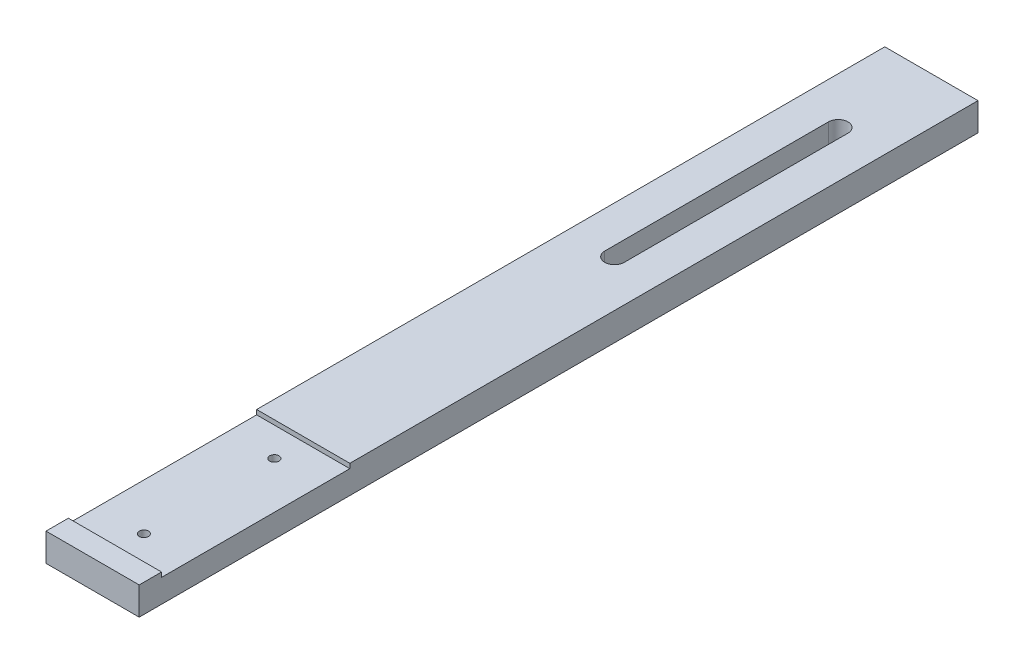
ISO-10303-21;
HEADER;
FILE_DESCRIPTION(('STEP AP214'),'2;1');
FILE_NAME('part.step','',(''),(''),'','','');
FILE_SCHEMA(('AUTOMOTIVE_DESIGN { 1 0 10303 214 1 1 1 1 }'));
ENDSEC;
DATA;
#1=APPLICATION_CONTEXT('core data for automotive mechanical design processes');
#2=APPLICATION_PROTOCOL_DEFINITION('international standard','automotive_design',2000,#1);
#3=PRODUCT_CONTEXT('',#1,'mechanical');
#4=PRODUCT('Part','Part','',(#3));
#5=PRODUCT_RELATED_PRODUCT_CATEGORY('part','',(#4));
#6=PRODUCT_DEFINITION_FORMATION('','',#4);
#7=PRODUCT_DEFINITION_CONTEXT('part definition',#1,'design');
#8=PRODUCT_DEFINITION('design','',#6,#7);
#9=PRODUCT_DEFINITION_SHAPE('','',#8);
#10=(LENGTH_UNIT() NAMED_UNIT(*) SI_UNIT(.MILLI.,.METRE.));
#11=(NAMED_UNIT(*) PLANE_ANGLE_UNIT() SI_UNIT($,.RADIAN.));
#12=(NAMED_UNIT(*) SI_UNIT($,.STERADIAN.) SOLID_ANGLE_UNIT());
#13=UNCERTAINTY_MEASURE_WITH_UNIT(LENGTH_MEASURE(1.E-05),#10,'distance_accuracy_value','');
#14=(GEOMETRIC_REPRESENTATION_CONTEXT(3) GLOBAL_UNCERTAINTY_ASSIGNED_CONTEXT((#13)) GLOBAL_UNIT_ASSIGNED_CONTEXT((#10,
#11,#12)) REPRESENTATION_CONTEXT('',''));
#15=CARTESIAN_POINT('',(0.,0.,0.));
#16=DIRECTION('',(0.,0.,1.));
#17=DIRECTION('',(1.,0.,0.));
#18=AXIS2_PLACEMENT_3D('',#15,#16,#17);
#19=CARTESIAN_POINT('',(8.32667268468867E-13,15.,450.));
#20=DIRECTION('',(0.,-1.,0.));
#21=DIRECTION('',(0.,0.,-1.));
#22=AXIS2_PLACEMENT_3D('',#19,#20,#21);
#23=PLANE('',#22);
#24=DIRECTION('',(0.,0.,-1.));
#25=VECTOR('',#24,1.);
#26=CARTESIAN_POINT('',(50.0000000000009,15.,450.));
#27=LINE('',#26,#25);
#28=CARTESIAN_POINT('',(50.0000000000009,15.,450.));
#29=VERTEX_POINT('',#28);
#30=CARTESIAN_POINT('',(50.0000000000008,15.,438.));
#31=VERTEX_POINT('',#30);
#32=EDGE_CURVE('E266',#29,#31,#27,.T.);
#33=ORIENTED_EDGE('',*,*,#32,.T.);
#34=DIRECTION('',(0.999999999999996,0.,0.));
#35=VECTOR('',#34,1.);
#36=CARTESIAN_POINT('',(-0.000999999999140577,15.,438.));
#37=LINE('',#36,#35);
#38=CARTESIAN_POINT('',(8.32667268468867E-13,15.,438.));
#39=VERTEX_POINT('',#38);
#40=EDGE_CURVE('E170',#39,#31,#37,.T.);
#41=ORIENTED_EDGE('',*,*,#40,.F.);
#42=DIRECTION('',(0.,0.,-1.));
#43=VECTOR('',#42,1.);
#44=CARTESIAN_POINT('',(8.32667268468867E-13,15.,450.));
#45=LINE('',#44,#43);
#46=CARTESIAN_POINT('',(8.32667268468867E-13,15.,450.));
#47=VERTEX_POINT('',#46);
#48=EDGE_CURVE('E156',#47,#39,#45,.T.);
#49=ORIENTED_EDGE('',*,*,#48,.F.);
#50=DIRECTION('',(-0.999999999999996,0.,0.));
#51=VECTOR('',#50,1.);
#52=CARTESIAN_POINT('',(8.32667268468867E-13,15.,450.));
#53=LINE('',#52,#51);
#54=EDGE_CURVE('E246',#29,#47,#53,.T.);
#55=ORIENTED_EDGE('',*,*,#54,.F.);
#56=EDGE_LOOP('',(#33,#41,#49,#55));
#57=FACE_BOUND('',#56,.T.);
#58=ADVANCED_FACE('F40',(#57),#23,.F.);
#59=CARTESIAN_POINT('',(8.88178419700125E-13,0.,450.));
#60=DIRECTION('',(0.999999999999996,0.,0.));
#61=DIRECTION('',(0.,0.,-1.));
#62=AXIS2_PLACEMENT_3D('',#59,#60,#61);
#63=PLANE('',#62);
#64=ORIENTED_EDGE('',*,*,#48,.T.);
#65=DIRECTION('',(0.,1.,0.));
#66=VECTOR('',#65,1.);
#67=CARTESIAN_POINT('',(8.32667268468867E-13,15.,438.));
#68=LINE('',#67,#66);
#69=CARTESIAN_POINT('',(8.32667268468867E-13,12.5000000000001,438.));
#70=VERTEX_POINT('',#69);
#71=EDGE_CURVE('E133',#70,#39,#68,.T.);
#72=ORIENTED_EDGE('',*,*,#71,.F.);
#73=DIRECTION('',(0.,0.,1.));
#74=VECTOR('',#73,1.);
#75=CARTESIAN_POINT('',(8.32667268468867E-13,12.5000000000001,438.));
#76=LINE('',#75,#74);
#77=CARTESIAN_POINT('',(8.32667268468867E-13,12.5000000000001,337.));
#78=VERTEX_POINT('',#77);
#79=EDGE_CURVE('E144',#78,#70,#76,.T.);
#80=ORIENTED_EDGE('',*,*,#79,.F.);
#81=DIRECTION('',(0.,-1.,0.));
#82=VECTOR('',#81,1.);
#83=CARTESIAN_POINT('',(8.32667268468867E-13,15.,337.));
#84=LINE('',#83,#82);
#85=CARTESIAN_POINT('',(8.32667268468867E-13,15.,337.));
#86=VERTEX_POINT('',#85);
#87=EDGE_CURVE('E158',#86,#78,#84,.T.);
#88=ORIENTED_EDGE('',*,*,#87,.F.);
#89=CARTESIAN_POINT('',(8.88178419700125E-13,15.,0.));
#90=VERTEX_POINT('',#89);
#91=EDGE_CURVE('E249',#86,#90,#45,.T.);
#92=ORIENTED_EDGE('',*,*,#91,.T.);
#93=DIRECTION('',(0.,-1.,0.));
#94=VECTOR('',#93,1.);
#95=CARTESIAN_POINT('',(8.88178419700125E-13,0.,0.));
#96=LINE('',#95,#94);
#97=CARTESIAN_POINT('',(8.88178419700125E-13,0.,0.));
#98=VERTEX_POINT('',#97);
#99=EDGE_CURVE('E234',#90,#98,#96,.T.);
#100=ORIENTED_EDGE('',*,*,#99,.T.);
#101=DIRECTION('',(0.,0.,-1.));
#102=VECTOR('',#101,1.);
#103=CARTESIAN_POINT('',(8.88178419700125E-13,0.,450.));
#104=LINE('',#103,#102);
#105=CARTESIAN_POINT('',(8.88178419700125E-13,0.,450.));
#106=VERTEX_POINT('',#105);
#107=EDGE_CURVE('E11',#106,#98,#104,.T.);
#108=ORIENTED_EDGE('',*,*,#107,.F.);
#109=DIRECTION('',(0.,-1.,0.));
#110=VECTOR('',#109,1.);
#111=CARTESIAN_POINT('',(8.88178419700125E-13,0.,450.));
#112=LINE('',#111,#110);
#113=EDGE_CURVE('E235',#47,#106,#112,.T.);
#114=ORIENTED_EDGE('',*,*,#113,.F.);
#115=EDGE_LOOP('',(#64,#72,#80,#88,#92,#100,#108,#114));
#116=FACE_BOUND('',#115,.T.);
#117=ADVANCED_FACE('F42',(#116),#63,.F.);
#118=CARTESIAN_POINT('',(8.88178419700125E-13,0.,450.));
#119=DIRECTION('',(0.,1.,0.));
#120=DIRECTION('',(0.,0.,1.));
#121=AXIS2_PLACEMENT_3D('',#118,#119,#120);
#122=PLANE('',#121);
#123=DIRECTION('',(0.,0.,1.));
#124=VECTOR('',#123,1.);
#125=CARTESIAN_POINT('',(19.7500000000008,0.,170.));
#126=LINE('',#125,#124);
#127=CARTESIAN_POINT('',(19.7500000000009,0.,50.));
#128=VERTEX_POINT('',#127);
#129=CARTESIAN_POINT('',(19.7500000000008,0.,170.));
#130=VERTEX_POINT('',#129);
#131=EDGE_CURVE('E196',#128,#130,#126,.T.);
#132=ORIENTED_EDGE('',*,*,#131,.T.);
#133=CARTESIAN_POINT('',(25.0000000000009,0.,170.));
#134=DIRECTION('',(0.,1.,0.));
#135=DIRECTION('',(0.,0.,-1.));
#136=AXIS2_PLACEMENT_3D('',#133,#134,#135);
#137=CIRCLE('',#136,5.25);
#138=CARTESIAN_POINT('',(30.2500000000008,0.,170.));
#139=VERTEX_POINT('',#138);
#140=EDGE_CURVE('E185',#130,#139,#137,.T.);
#141=ORIENTED_EDGE('',*,*,#140,.T.);
#142=DIRECTION('',(0.,0.,-1.));
#143=VECTOR('',#142,1.);
#144=CARTESIAN_POINT('',(30.2500000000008,0.,170.));
#145=LINE('',#144,#143);
#146=CARTESIAN_POINT('',(30.2500000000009,0.,50.));
#147=VERTEX_POINT('',#146);
#148=EDGE_CURVE('E189',#139,#147,#145,.T.);
#149=ORIENTED_EDGE('',*,*,#148,.T.);
#150=CARTESIAN_POINT('',(25.0000000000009,0.,50.0000000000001));
#151=DIRECTION('',(0.,1.,0.));
#152=DIRECTION('',(0.,0.,1.));
#153=AXIS2_PLACEMENT_3D('',#150,#151,#152);
#154=CIRCLE('',#153,5.25);
#155=EDGE_CURVE('E64',#147,#128,#154,.T.);
#156=ORIENTED_EDGE('',*,*,#155,.T.);
#157=EDGE_LOOP('',(#132,#141,#149,#156));
#158=FACE_BOUND('',#157,.T.);
#159=CARTESIAN_POINT('',(25.0000000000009,0.,352.5));
#160=DIRECTION('',(0.,1.,0.));
#161=DIRECTION('',(0.,0.,1.));
#162=AXIS2_PLACEMENT_3D('',#159,#160,#161);
#163=CIRCLE('',#162,2.5);
#164=CARTESIAN_POINT('',(25.0000000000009,0.,355.));
#165=VERTEX_POINT('',#164);
#166=EDGE_CURVE('E217',#165,#165,#163,.T.);
#167=ORIENTED_EDGE('',*,*,#166,.T.);
#168=EDGE_LOOP('',(#167));
#169=FACE_BOUND('',#168,.T.);
#170=CARTESIAN_POINT('',(25.0000000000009,0.,422.5));
#171=DIRECTION('',(0.,1.,0.));
#172=DIRECTION('',(0.,0.,1.));
#173=AXIS2_PLACEMENT_3D('',#170,#171,#172);
#174=CIRCLE('',#173,2.5);
#175=CARTESIAN_POINT('',(25.0000000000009,0.,425.));
#176=VERTEX_POINT('',#175);
#177=EDGE_CURVE('E230',#176,#176,#174,.T.);
#178=ORIENTED_EDGE('',*,*,#177,.T.);
#179=EDGE_LOOP('',(#178));
#180=FACE_BOUND('',#179,.T.);
#181=DIRECTION('',(0.999999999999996,0.,0.));
#182=VECTOR('',#181,1.);
#183=CARTESIAN_POINT('',(8.88178419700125E-13,0.,0.));
#184=LINE('',#183,#182);
#185=CARTESIAN_POINT('',(50.0000000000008,0.,0.));
#186=VERTEX_POINT('',#185);
#187=EDGE_CURVE('E253',#98,#186,#184,.T.);
#188=ORIENTED_EDGE('',*,*,#187,.T.);
#189=DIRECTION('',(0.,0.,-1.));
#190=VECTOR('',#189,1.);
#191=CARTESIAN_POINT('',(50.0000000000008,0.,450.));
#192=LINE('',#191,#190);
#193=CARTESIAN_POINT('',(50.0000000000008,0.,450.));
#194=VERTEX_POINT('',#193);
#195=EDGE_CURVE('E49',#194,#186,#192,.T.);
#196=ORIENTED_EDGE('',*,*,#195,.F.);
#197=DIRECTION('',(0.999999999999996,0.,0.));
#198=VECTOR('',#197,1.);
#199=CARTESIAN_POINT('',(8.88178419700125E-13,0.,450.));
#200=LINE('',#199,#198);
#201=EDGE_CURVE('E239',#106,#194,#200,.T.);
#202=ORIENTED_EDGE('',*,*,#201,.F.);
#203=ORIENTED_EDGE('',*,*,#107,.T.);
#204=EDGE_LOOP('',(#188,#196,#202,#203));
#205=FACE_BOUND('',#204,.T.);
#206=ADVANCED_FACE('F294',(#158,#169,#180,#205),#122,.F.);
#207=CARTESIAN_POINT('',(50.0000000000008,0.,450.));
#208=DIRECTION('',(-0.999999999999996,0.,0.));
#209=DIRECTION('',(0.,0.,1.));
#210=AXIS2_PLACEMENT_3D('',#207,#208,#209);
#211=PLANE('',#210);
#212=DIRECTION('',(0.,0.,-1.));
#213=VECTOR('',#212,1.);
#214=CARTESIAN_POINT('',(50.0000000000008,12.5000000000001,438.));
#215=LINE('',#214,#213);
#216=CARTESIAN_POINT('',(50.0000000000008,12.5000000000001,438.));
#217=VERTEX_POINT('',#216);
#218=CARTESIAN_POINT('',(50.0000000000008,12.5000000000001,337.));
#219=VERTEX_POINT('',#218);
#220=EDGE_CURVE('E161',#217,#219,#215,.T.);
#221=ORIENTED_EDGE('',*,*,#220,.F.);
#222=DIRECTION('',(0.,-1.,0.));
#223=VECTOR('',#222,1.);
#224=CARTESIAN_POINT('',(50.0000000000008,15.,438.));
#225=LINE('',#224,#223);
#226=EDGE_CURVE('E136',#31,#217,#225,.T.);
#227=ORIENTED_EDGE('',*,*,#226,.F.);
#228=ORIENTED_EDGE('',*,*,#32,.F.);
#229=DIRECTION('',(0.,1.,0.));
#230=VECTOR('',#229,1.);
#231=CARTESIAN_POINT('',(50.0000000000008,0.,450.));
#232=LINE('',#231,#230);
#233=EDGE_CURVE('E243',#194,#29,#232,.T.);
#234=ORIENTED_EDGE('',*,*,#233,.F.);
#235=ORIENTED_EDGE('',*,*,#195,.T.);
#236=DIRECTION('',(0.,1.,0.));
#237=VECTOR('',#236,1.);
#238=CARTESIAN_POINT('',(50.0000000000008,0.,0.));
#239=LINE('',#238,#237);
#240=CARTESIAN_POINT('',(50.0000000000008,15.,0.));
#241=VERTEX_POINT('',#240);
#242=EDGE_CURVE('E256',#186,#241,#239,.T.);
#243=ORIENTED_EDGE('',*,*,#242,.T.);
#244=CARTESIAN_POINT('',(50.0000000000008,15.,337.));
#245=VERTEX_POINT('',#244);
#246=EDGE_CURVE('E265',#245,#241,#27,.T.);
#247=ORIENTED_EDGE('',*,*,#246,.F.);
#248=DIRECTION('',(0.,1.,0.));
#249=VECTOR('',#248,1.);
#250=CARTESIAN_POINT('',(50.0000000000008,15.,337.));
#251=LINE('',#250,#249);
#252=EDGE_CURVE('E56',#219,#245,#251,.T.);
#253=ORIENTED_EDGE('',*,*,#252,.F.);
#254=EDGE_LOOP('',(#221,#227,#228,#234,#235,#243,#247,#253));
#255=FACE_BOUND('',#254,.T.);
#256=ADVANCED_FACE('F275',(#255),#211,.F.);
#257=DIRECTION('',(0.,0.,-1.));
#258=VECTOR('',#257,1.);
#259=CARTESIAN_POINT('',(30.2500000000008,15.,170.));
#260=LINE('',#259,#258);
#261=CARTESIAN_POINT('',(30.2500000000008,15.,170.));
#262=VERTEX_POINT('',#261);
#263=CARTESIAN_POINT('',(30.2500000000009,15.,50.));
#264=VERTEX_POINT('',#263);
#265=EDGE_CURVE('E203',#262,#264,#260,.T.);
#266=ORIENTED_EDGE('',*,*,#265,.F.);
#267=CARTESIAN_POINT('',(25.0000000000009,15.,170.));
#268=DIRECTION('',(0.,1.,0.));
#269=DIRECTION('',(0.,0.,-1.));
#270=AXIS2_PLACEMENT_3D('',#267,#268,#269);
#271=CIRCLE('',#270,5.25);
#272=CARTESIAN_POINT('',(19.7500000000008,15.,170.));
#273=VERTEX_POINT('',#272);
#274=EDGE_CURVE('E150',#273,#262,#271,.T.);
#275=ORIENTED_EDGE('',*,*,#274,.F.);
#276=DIRECTION('',(0.,0.,1.));
#277=VECTOR('',#276,1.);
#278=CARTESIAN_POINT('',(19.7500000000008,15.,170.));
#279=LINE('',#278,#277);
#280=CARTESIAN_POINT('',(19.7500000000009,15.,50.));
#281=VERTEX_POINT('',#280);
#282=EDGE_CURVE('E190',#281,#273,#279,.T.);
#283=ORIENTED_EDGE('',*,*,#282,.F.);
#284=CARTESIAN_POINT('',(25.0000000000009,15.,50.0000000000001));
#285=DIRECTION('',(0.,1.,0.));
#286=DIRECTION('',(0.,0.,1.));
#287=AXIS2_PLACEMENT_3D('',#284,#285,#286);
#288=CIRCLE('',#287,5.25);
#289=EDGE_CURVE('E207',#264,#281,#288,.T.);
#290=ORIENTED_EDGE('',*,*,#289,.F.);
#291=EDGE_LOOP('',(#266,#275,#283,#290));
#292=FACE_BOUND('',#291,.T.);
#293=ORIENTED_EDGE('',*,*,#91,.F.);
#294=DIRECTION('',(0.999999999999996,0.,0.));
#295=VECTOR('',#294,1.);
#296=CARTESIAN_POINT('',(-0.000999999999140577,15.,337.));
#297=LINE('',#296,#295);
#298=EDGE_CURVE('E174',#86,#245,#297,.T.);
#299=ORIENTED_EDGE('',*,*,#298,.T.);
#300=ORIENTED_EDGE('',*,*,#246,.T.);
#301=DIRECTION('',(-0.999999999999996,0.,0.));
#302=VECTOR('',#301,1.);
#303=CARTESIAN_POINT('',(8.88178419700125E-13,15.,0.));
#304=LINE('',#303,#302);
#305=EDGE_CURVE('E240',#241,#90,#304,.T.);
#306=ORIENTED_EDGE('',*,*,#305,.T.);
#307=EDGE_LOOP('',(#293,#299,#300,#306));
#308=FACE_BOUND('',#307,.T.);
#309=ADVANCED_FACE('F285',(#292,#308),#23,.F.);
#310=CARTESIAN_POINT('',(8.32667268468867E-13,15.,450.));
#311=DIRECTION('',(0.,0.,-1.));
#312=DIRECTION('',(-0.999999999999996,0.,0.));
#313=AXIS2_PLACEMENT_3D('',#310,#311,#312);
#314=PLANE('',#313);
#315=ORIENTED_EDGE('',*,*,#113,.T.);
#316=ORIENTED_EDGE('',*,*,#201,.T.);
#317=ORIENTED_EDGE('',*,*,#233,.T.);
#318=ORIENTED_EDGE('',*,*,#54,.T.);
#319=EDGE_LOOP('',(#315,#316,#317,#318));
#320=FACE_BOUND('',#319,.T.);
#321=ADVANCED_FACE('F293',(#320),#314,.F.);
#322=CARTESIAN_POINT('',(8.88178419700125E-13,15.,0.));
#323=DIRECTION('',(0.,0.,-1.));
#324=DIRECTION('',(-0.999999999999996,0.,0.));
#325=AXIS2_PLACEMENT_3D('',#322,#323,#324);
#326=PLANE('',#325);
#327=ORIENTED_EDGE('',*,*,#99,.F.);
#328=ORIENTED_EDGE('',*,*,#305,.F.);
#329=ORIENTED_EDGE('',*,*,#242,.F.);
#330=ORIENTED_EDGE('',*,*,#187,.F.);
#331=EDGE_LOOP('',(#327,#328,#329,#330));
#332=FACE_BOUND('',#331,.T.);
#333=ADVANCED_FACE('F282',(#332),#326,.T.);
#334=CARTESIAN_POINT('',(25.0000000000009,15.,422.5));
#335=DIRECTION('',(0.,1.,0.));
#336=DIRECTION('',(0.,0.,1.));
#337=AXIS2_PLACEMENT_3D('',#334,#335,#336);
#338=CYLINDRICAL_SURFACE('',#337,2.5);
#339=CARTESIAN_POINT('',(25.0000000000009,12.5000000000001,422.5));
#340=DIRECTION('',(0.,-1.,0.));
#341=DIRECTION('',(0.,0.,-1.));
#342=AXIS2_PLACEMENT_3D('',#339,#340,#341);
#343=CIRCLE('',#342,2.5);
#344=CARTESIAN_POINT('',(25.0000000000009,12.5000000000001,420.));
#345=VERTEX_POINT('',#344);
#346=EDGE_CURVE('E151',#345,#345,#343,.T.);
#347=ORIENTED_EDGE('',*,*,#346,.F.);
#348=EDGE_LOOP('',(#347));
#349=FACE_BOUND('',#348,.T.);
#350=ORIENTED_EDGE('',*,*,#177,.F.);
#351=EDGE_LOOP('',(#350));
#352=FACE_BOUND('',#351,.T.);
#353=ADVANCED_FACE('F343',(#349,#352),#338,.F.);
#354=CARTESIAN_POINT('',(25.0000000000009,15.,352.5));
#355=DIRECTION('',(0.,1.,0.));
#356=DIRECTION('',(0.,0.,1.));
#357=AXIS2_PLACEMENT_3D('',#354,#355,#356);
#358=CYLINDRICAL_SURFACE('',#357,2.5);
#359=CARTESIAN_POINT('',(25.0000000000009,12.5000000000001,352.5));
#360=DIRECTION('',(0.,-1.,0.));
#361=DIRECTION('',(0.,0.,-1.));
#362=AXIS2_PLACEMENT_3D('',#359,#360,#361);
#363=CIRCLE('',#362,2.5);
#364=CARTESIAN_POINT('',(25.0000000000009,12.5000000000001,350.));
#365=VERTEX_POINT('',#364);
#366=EDGE_CURVE('E173',#365,#365,#363,.T.);
#367=ORIENTED_EDGE('',*,*,#366,.F.);
#368=EDGE_LOOP('',(#367));
#369=FACE_BOUND('',#368,.T.);
#370=ORIENTED_EDGE('',*,*,#166,.F.);
#371=EDGE_LOOP('',(#370));
#372=FACE_BOUND('',#371,.T.);
#373=ADVANCED_FACE('F340',(#369,#372),#358,.F.);
#374=CARTESIAN_POINT('',(25.0000000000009,0.,170.));
#375=DIRECTION('',(0.,1.,0.));
#376=DIRECTION('',(0.,0.,1.));
#377=AXIS2_PLACEMENT_3D('',#374,#375,#376);
#378=CYLINDRICAL_SURFACE('',#377,5.25);
#379=ORIENTED_EDGE('',*,*,#274,.T.);
#380=DIRECTION('',(0.,1.,0.));
#381=VECTOR('',#380,1.);
#382=CARTESIAN_POINT('',(30.2500000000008,0.,170.));
#383=LINE('',#382,#381);
#384=EDGE_CURVE('E200',#139,#262,#383,.T.);
#385=ORIENTED_EDGE('',*,*,#384,.F.);
#386=ORIENTED_EDGE('',*,*,#140,.F.);
#387=DIRECTION('',(0.,1.,0.));
#388=VECTOR('',#387,1.);
#389=CARTESIAN_POINT('',(19.7500000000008,0.,170.));
#390=LINE('',#389,#388);
#391=EDGE_CURVE('E214',#130,#273,#390,.T.);
#392=ORIENTED_EDGE('',*,*,#391,.T.);
#393=EDGE_LOOP('',(#379,#385,#386,#392));
#394=FACE_BOUND('',#393,.T.);
#395=ADVANCED_FACE('F323',(#394),#378,.F.);
#396=CARTESIAN_POINT('',(19.7500000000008,0.,170.));
#397=DIRECTION('',(-0.999999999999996,0.,0.));
#398=DIRECTION('',(0.,0.,1.));
#399=AXIS2_PLACEMENT_3D('',#396,#397,#398);
#400=PLANE('',#399);
#401=ORIENTED_EDGE('',*,*,#282,.T.);
#402=ORIENTED_EDGE('',*,*,#391,.F.);
#403=ORIENTED_EDGE('',*,*,#131,.F.);
#404=DIRECTION('',(0.,1.,0.));
#405=VECTOR('',#404,1.);
#406=CARTESIAN_POINT('',(19.7500000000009,0.,50.));
#407=LINE('',#406,#405);
#408=EDGE_CURVE('E218',#128,#281,#407,.T.);
#409=ORIENTED_EDGE('',*,*,#408,.T.);
#410=EDGE_LOOP('',(#401,#402,#403,#409));
#411=FACE_BOUND('',#410,.T.);
#412=ADVANCED_FACE('F326',(#411),#400,.F.);
#413=CARTESIAN_POINT('',(25.0000000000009,0.,50.0000000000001));
#414=DIRECTION('',(0.,1.,0.));
#415=DIRECTION('',(0.,0.,1.));
#416=AXIS2_PLACEMENT_3D('',#413,#414,#415);
#417=CYLINDRICAL_SURFACE('',#416,5.25);
#418=ORIENTED_EDGE('',*,*,#289,.T.);
#419=ORIENTED_EDGE('',*,*,#408,.F.);
#420=ORIENTED_EDGE('',*,*,#155,.F.);
#421=DIRECTION('',(0.,1.,0.));
#422=VECTOR('',#421,1.);
#423=CARTESIAN_POINT('',(30.2500000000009,0.,50.));
#424=LINE('',#423,#422);
#425=EDGE_CURVE('E221',#147,#264,#424,.T.);
#426=ORIENTED_EDGE('',*,*,#425,.T.);
#427=EDGE_LOOP('',(#418,#419,#420,#426));
#428=FACE_BOUND('',#427,.T.);
#429=ADVANCED_FACE('F327',(#428),#417,.F.);
#430=CARTESIAN_POINT('',(30.2500000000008,0.,170.));
#431=DIRECTION('',(0.999999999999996,0.,0.));
#432=DIRECTION('',(0.,0.,-1.));
#433=AXIS2_PLACEMENT_3D('',#430,#431,#432);
#434=PLANE('',#433);
#435=ORIENTED_EDGE('',*,*,#265,.T.);
#436=ORIENTED_EDGE('',*,*,#425,.F.);
#437=ORIENTED_EDGE('',*,*,#148,.F.);
#438=ORIENTED_EDGE('',*,*,#384,.T.);
#439=EDGE_LOOP('',(#435,#436,#437,#438));
#440=FACE_BOUND('',#439,.T.);
#441=ADVANCED_FACE('F319',(#440),#434,.F.);
#442=CARTESIAN_POINT('',(-0.000999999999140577,15.,438.));
#443=DIRECTION('',(0.,0.,1.));
#444=DIRECTION('',(0.999999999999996,0.,0.));
#445=AXIS2_PLACEMENT_3D('',#442,#443,#444);
#446=PLANE('',#445);
#447=ORIENTED_EDGE('',*,*,#71,.T.);
#448=ORIENTED_EDGE('',*,*,#40,.T.);
#449=ORIENTED_EDGE('',*,*,#226,.T.);
#450=DIRECTION('',(0.999999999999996,0.,0.));
#451=VECTOR('',#450,1.);
#452=CARTESIAN_POINT('',(-0.000999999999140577,12.5000000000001,438.));
#453=LINE('',#452,#451);
#454=EDGE_CURVE('E129',#70,#217,#453,.T.);
#455=ORIENTED_EDGE('',*,*,#454,.F.);
#456=EDGE_LOOP('',(#447,#448,#449,#455));
#457=FACE_BOUND('',#456,.T.);
#458=ADVANCED_FACE('F131',(#457),#446,.F.);
#459=CARTESIAN_POINT('',(-0.000999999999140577,15.,337.));
#460=DIRECTION('',(0.,0.,-1.));
#461=DIRECTION('',(-0.999999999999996,0.,0.));
#462=AXIS2_PLACEMENT_3D('',#459,#460,#461);
#463=PLANE('',#462);
#464=ORIENTED_EDGE('',*,*,#87,.T.);
#465=DIRECTION('',(0.999999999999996,0.,0.));
#466=VECTOR('',#465,1.);
#467=CARTESIAN_POINT('',(-0.000999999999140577,12.5000000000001,337.));
#468=LINE('',#467,#466);
#469=EDGE_CURVE('E141',#78,#219,#468,.T.);
#470=ORIENTED_EDGE('',*,*,#469,.T.);
#471=ORIENTED_EDGE('',*,*,#252,.T.);
#472=ORIENTED_EDGE('',*,*,#298,.F.);
#473=EDGE_LOOP('',(#464,#470,#471,#472));
#474=FACE_BOUND('',#473,.T.);
#475=ADVANCED_FACE('F289',(#474),#463,.F.);
#476=CARTESIAN_POINT('',(-0.000999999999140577,12.5000000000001,438.));
#477=DIRECTION('',(0.,-1.,0.));
#478=DIRECTION('',(0.,0.,-1.));
#479=AXIS2_PLACEMENT_3D('',#476,#477,#478);
#480=PLANE('',#479);
#481=ORIENTED_EDGE('',*,*,#346,.T.);
#482=EDGE_LOOP('',(#481));
#483=FACE_BOUND('',#482,.T.);
#484=ORIENTED_EDGE('',*,*,#366,.T.);
#485=EDGE_LOOP('',(#484));
#486=FACE_BOUND('',#485,.T.);
#487=ORIENTED_EDGE('',*,*,#79,.T.);
#488=ORIENTED_EDGE('',*,*,#454,.T.);
#489=ORIENTED_EDGE('',*,*,#220,.T.);
#490=ORIENTED_EDGE('',*,*,#469,.F.);
#491=EDGE_LOOP('',(#487,#488,#489,#490));
#492=FACE_BOUND('',#491,.T.);
#493=ADVANCED_FACE('F145',(#483,#486,#492),#480,.F.);
#494=CLOSED_SHELL('',(#58,#117,#206,#256,#309,#321,#333,#353,#373,#395,#412,#429,#441,#458,#475,#493));
#495=MANIFOLD_SOLID_BREP('B2',#494);
#496=ADVANCED_BREP_SHAPE_REPRESENTATION('',(#18,#495),#14);
#497=SHAPE_DEFINITION_REPRESENTATION(#9,#496);
ENDSEC;
END-ISO-10303-21;
